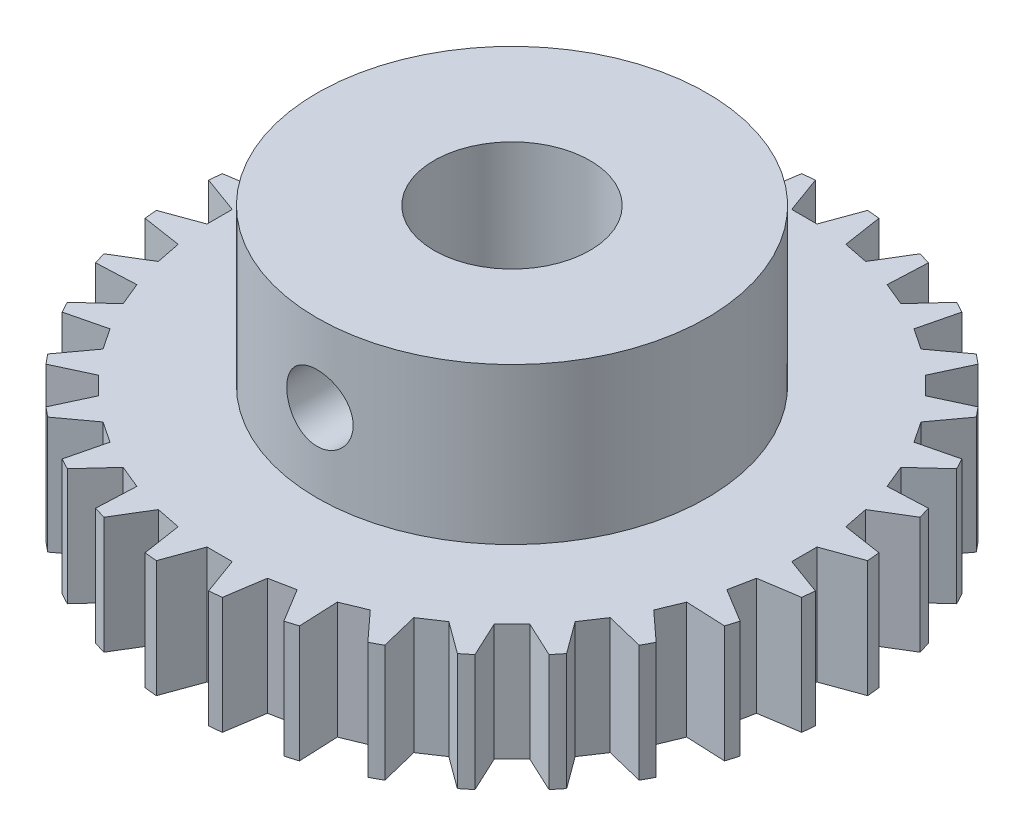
from build123d import *

# Parameters (mm, degrees)
SKETCH1_R          = 13.462
SKETCH1_R_2        = 3.175
EXTRUDE1_DEPTH     = 4.7625
SKETCH2_R          = 7.9375
SKETCH2_R_2        = 3.175
EXTRUDE2_DEPTH     = 6.35
CUT_EXTRUDE1_REACH = 24.044
CIRPATTERN1_COUNT  = 32
SKETCH4_W          = 1.35255
SKETCH4_H          = 13.419788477


with BuildPart() as part:
    # Sketch1 → Extrude1 (new body)
    with BuildSketch(Plane(origin=(0, 0, 0), x_dir=(1, 0, 0), z_dir=(0, 1, 0))):
        with Locations(Location((0, 0, 0), (0, 0, 90))):
            Circle(SKETCH1_R)
        with Locations(Location((0, 0, 0), (0, 0, 90))):
            Circle(SKETCH1_R_2, mode=Mode.SUBTRACT)
    extrude(amount=EXTRUDE1_DEPTH)

    # Sketch2 → Extrude2 (add)
    with BuildSketch(Plane(origin=(0, 4.7625, 0), x_dir=(1, 0, 0), z_dir=(0, 1, 0))):
        with Locations(Location((0, 0, 0), (0, 0, 270))):
            Circle(SKETCH2_R)
        with Locations(Location((0, 0, 0), (0, 0, 90))):
            Circle(SKETCH2_R_2, mode=Mode.SUBTRACT)
    extrude(amount=EXTRUDE2_DEPTH)

    # Sketch3 → Cut-Extrude1 (cut, up to next)
    with BuildSketch(Plane.XZ, mode=Mode.PRIVATE) as cut_extrude1_sk1:
        Polygon((-13.462, -1.080596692), (-13.462, 1.080596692), (-11.90625, 0.51435), (-11.90625, -0.51435), align=None)
    cut_extrude1_tool1 = extrude(cut_extrude1_sk1.sketch, amount=-CUT_EXTRUDE1_REACH, mode=Mode.PRIVATE) & part.part
    cut_extrude1 = cut_extrude1_tool1.solids().sort_by_distance((-12.77618, 0, 0))[0]
    add(cut_extrude1, mode=Mode.SUBTRACT)

    # CirPattern1: Cut-Extrude1 ×32 about axis
    cirpattern1_axis = Axis((0, 0, 0), (0, 1, 0))
    for i in range(1, CIRPATTERN1_COUNT):
        add(cut_extrude1.rotate(cirpattern1_axis, i * 360 / CIRPATTERN1_COUNT), mode=Mode.SUBTRACT)

    # Sketch4 → 6-32 Tapped Hole1 (revolve, cut)
    with BuildSketch(Plane(origin=(0, 7.9375, 0), x_dir=(0, 1, 0), z_dir=(1, 0, 0))):
        with Locations((0.676275, 6.709894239)):
            Rectangle(SKETCH4_W, SKETCH4_H)
    revolve(axis=Axis((0, 7.9375, -6.35), (0, 0, 1)), mode=Mode.SUBTRACT)


solid = part.part
